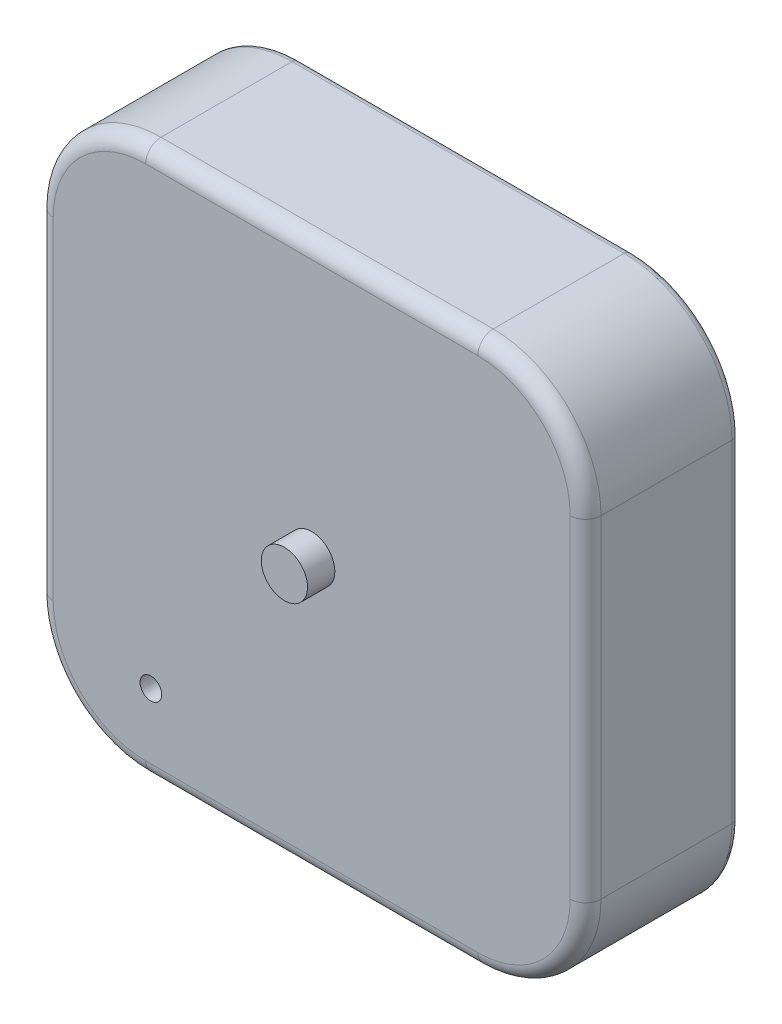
ISO-10303-21;
HEADER;
FILE_DESCRIPTION(('STEP AP214'),'2;1');
FILE_NAME('part.step','',(''),(''),'','','');
FILE_SCHEMA(('AUTOMOTIVE_DESIGN { 1 0 10303 214 1 1 1 1 }'));
ENDSEC;
DATA;
#1=APPLICATION_CONTEXT('core data for automotive mechanical design processes');
#2=APPLICATION_PROTOCOL_DEFINITION('international standard','automotive_design',2000,#1);
#3=PRODUCT_CONTEXT('',#1,'mechanical');
#4=PRODUCT('Part','Part','',(#3));
#5=PRODUCT_RELATED_PRODUCT_CATEGORY('part','',(#4));
#6=PRODUCT_DEFINITION_FORMATION('','',#4);
#7=PRODUCT_DEFINITION_CONTEXT('part definition',#1,'design');
#8=PRODUCT_DEFINITION('design','',#6,#7);
#9=PRODUCT_DEFINITION_SHAPE('','',#8);
#10=(LENGTH_UNIT() NAMED_UNIT(*) SI_UNIT(.MILLI.,.METRE.));
#11=(NAMED_UNIT(*) PLANE_ANGLE_UNIT() SI_UNIT($,.RADIAN.));
#12=(NAMED_UNIT(*) SI_UNIT($,.STERADIAN.) SOLID_ANGLE_UNIT());
#13=UNCERTAINTY_MEASURE_WITH_UNIT(LENGTH_MEASURE(1.E-05),#10,'distance_accuracy_value','');
#14=(GEOMETRIC_REPRESENTATION_CONTEXT(3) GLOBAL_UNCERTAINTY_ASSIGNED_CONTEXT((#13)) GLOBAL_UNIT_ASSIGNED_CONTEXT((#10,
#11,#12)) REPRESENTATION_CONTEXT('',''));
#15=CARTESIAN_POINT('',(0.,0.,0.));
#16=DIRECTION('',(0.,0.,1.));
#17=DIRECTION('',(1.,0.,0.));
#18=AXIS2_PLACEMENT_3D('',#15,#16,#17);
#19=CARTESIAN_POINT('',(0.,0.,0.));
#20=DIRECTION('',(0.,0.,1.));
#21=DIRECTION('',(1.,0.,0.));
#22=AXIS2_PLACEMENT_3D('',#19,#20,#21);
#23=PLANE('',#22);
#24=DIRECTION('',(1.,0.,0.));
#25=VECTOR('',#24,1.);
#26=CARTESIAN_POINT('',(0.,-172.8,0.));
#27=LINE('',#26,#25);
#28=CARTESIAN_POINT('',(107.8,-172.8,0.));
#29=VERTEX_POINT('',#28);
#30=CARTESIAN_POINT('',(-107.8,-172.8,0.));
#31=VERTEX_POINT('',#30);
#32=EDGE_CURVE('E185',#29,#31,#27,.F.);
#33=ORIENTED_EDGE('',*,*,#32,.T.);
#34=CARTESIAN_POINT('',(-107.8,-107.8,0.));
#35=DIRECTION('',(0.,0.,1.));
#36=DIRECTION('',(1.,0.,0.));
#37=AXIS2_PLACEMENT_3D('',#34,#35,#36);
#38=CIRCLE('',#37,65.);
#39=CARTESIAN_POINT('',(-172.8,-107.8,0.));
#40=VERTEX_POINT('',#39);
#41=EDGE_CURVE('E224',#31,#40,#38,.F.);
#42=ORIENTED_EDGE('',*,*,#41,.T.);
#43=DIRECTION('',(0.,-1.,0.));
#44=VECTOR('',#43,1.);
#45=CARTESIAN_POINT('',(-172.8,0.,0.));
#46=LINE('',#45,#44);
#47=CARTESIAN_POINT('',(-172.8,107.8,0.));
#48=VERTEX_POINT('',#47);
#49=EDGE_CURVE('E222',#40,#48,#46,.F.);
#50=ORIENTED_EDGE('',*,*,#49,.T.);
#51=CARTESIAN_POINT('',(-107.8,107.8,0.));
#52=DIRECTION('',(0.,0.,1.));
#53=DIRECTION('',(1.,0.,0.));
#54=AXIS2_PLACEMENT_3D('',#51,#52,#53);
#55=CIRCLE('',#54,65.);
#56=CARTESIAN_POINT('',(-107.8,172.8,0.));
#57=VERTEX_POINT('',#56);
#58=EDGE_CURVE('E220',#48,#57,#55,.F.);
#59=ORIENTED_EDGE('',*,*,#58,.T.);
#60=DIRECTION('',(1.,0.,0.));
#61=VECTOR('',#60,1.);
#62=CARTESIAN_POINT('',(107.8,172.8,0.));
#63=LINE('',#62,#61);
#64=CARTESIAN_POINT('',(107.8,172.8,0.));
#65=VERTEX_POINT('',#64);
#66=EDGE_CURVE('E218',#57,#65,#63,.T.);
#67=ORIENTED_EDGE('',*,*,#66,.T.);
#68=CARTESIAN_POINT('',(107.8,107.8,0.));
#69=DIRECTION('',(0.,0.,1.));
#70=DIRECTION('',(1.,0.,0.));
#71=AXIS2_PLACEMENT_3D('',#68,#69,#70);
#72=CIRCLE('',#71,65.);
#73=CARTESIAN_POINT('',(172.8,107.8,0.));
#74=VERTEX_POINT('',#73);
#75=EDGE_CURVE('E216',#65,#74,#72,.F.);
#76=ORIENTED_EDGE('',*,*,#75,.T.);
#77=DIRECTION('',(0.,-1.,0.));
#78=VECTOR('',#77,1.);
#79=CARTESIAN_POINT('',(172.8,-107.8,0.));
#80=LINE('',#79,#78);
#81=CARTESIAN_POINT('',(172.8,-107.8,0.));
#82=VERTEX_POINT('',#81);
#83=EDGE_CURVE('E188',#74,#82,#80,.T.);
#84=ORIENTED_EDGE('',*,*,#83,.T.);
#85=CARTESIAN_POINT('',(107.8,-107.8,0.));
#86=DIRECTION('',(0.,0.,1.));
#87=DIRECTION('',(1.,0.,0.));
#88=AXIS2_PLACEMENT_3D('',#85,#86,#87);
#89=CIRCLE('',#88,65.);
#90=EDGE_CURVE('E181',#82,#29,#89,.F.);
#91=ORIENTED_EDGE('',*,*,#90,.T.);
#92=EDGE_LOOP('',(#33,#42,#50,#59,#67,#76,#84,#91));
#93=FACE_BOUND('',#92,.T.);
#94=ADVANCED_FACE('F67',(#93),#23,.F.);
#95=CARTESIAN_POINT('',(-177.8,0.,100.));
#96=DIRECTION('',(1.,0.,0.));
#97=DIRECTION('',(0.,1.,0.));
#98=AXIS2_PLACEMENT_3D('',#95,#96,#97);
#99=PLANE('',#98);
#100=DIRECTION('',(0.,0.,-1.));
#101=VECTOR('',#100,1.);
#102=CARTESIAN_POINT('',(-177.8,-107.8,100.));
#103=LINE('',#102,#101);
#104=CARTESIAN_POINT('',(-177.8,-107.8,5.));
#105=VERTEX_POINT('',#104);
#106=CARTESIAN_POINT('',(-177.8,-107.8,90.));
#107=VERTEX_POINT('',#106);
#108=EDGE_CURVE('E208',#105,#107,#103,.F.);
#109=ORIENTED_EDGE('',*,*,#108,.T.);
#110=DIRECTION('',(0.,-1.,0.));
#111=VECTOR('',#110,1.);
#112=CARTESIAN_POINT('',(-177.8,107.8,90.));
#113=LINE('',#112,#111);
#114=CARTESIAN_POINT('',(-177.8,107.8,90.));
#115=VERTEX_POINT('',#114);
#116=EDGE_CURVE('E280',#107,#115,#113,.F.);
#117=ORIENTED_EDGE('',*,*,#116,.T.);
#118=DIRECTION('',(0.,0.,-1.));
#119=VECTOR('',#118,1.);
#120=CARTESIAN_POINT('',(-177.8,107.8,0.));
#121=LINE('',#120,#119);
#122=CARTESIAN_POINT('',(-177.8,107.8,5.));
#123=VERTEX_POINT('',#122);
#124=EDGE_CURVE('E211',#115,#123,#121,.T.);
#125=ORIENTED_EDGE('',*,*,#124,.T.);
#126=DIRECTION('',(0.,-1.,0.));
#127=VECTOR('',#126,1.);
#128=CARTESIAN_POINT('',(-177.8,0.,5.));
#129=LINE('',#128,#127);
#130=EDGE_CURVE('E229',#123,#105,#129,.T.);
#131=ORIENTED_EDGE('',*,*,#130,.T.);
#132=EDGE_LOOP('',(#109,#117,#125,#131));
#133=FACE_BOUND('',#132,.T.);
#134=ADVANCED_FACE('F340',(#133),#99,.F.);
#135=CARTESIAN_POINT('',(0.,177.8,100.));
#136=DIRECTION('',(0.,1.,0.));
#137=DIRECTION('',(0.,0.,1.));
#138=AXIS2_PLACEMENT_3D('',#135,#136,#137);
#139=PLANE('',#138);
#140=DIRECTION('',(0.,0.,-1.));
#141=VECTOR('',#140,1.);
#142=CARTESIAN_POINT('',(-107.8,177.8,100.));
#143=LINE('',#142,#141);
#144=CARTESIAN_POINT('',(-107.8,177.8,5.));
#145=VERTEX_POINT('',#144);
#146=CARTESIAN_POINT('',(-107.8,177.8,90.));
#147=VERTEX_POINT('',#146);
#148=EDGE_CURVE('E351',#145,#147,#143,.F.);
#149=ORIENTED_EDGE('',*,*,#148,.T.);
#150=DIRECTION('',(1.,0.,0.));
#151=VECTOR('',#150,1.);
#152=CARTESIAN_POINT('',(0.,177.8,90.));
#153=LINE('',#152,#151);
#154=CARTESIAN_POINT('',(107.8,177.8,90.));
#155=VERTEX_POINT('',#154);
#156=EDGE_CURVE('E284',#147,#155,#153,.T.);
#157=ORIENTED_EDGE('',*,*,#156,.T.);
#158=DIRECTION('',(0.,0.,-1.));
#159=VECTOR('',#158,1.);
#160=CARTESIAN_POINT('',(107.8,177.8,100.));
#161=LINE('',#160,#159);
#162=CARTESIAN_POINT('',(107.8,177.8,5.));
#163=VERTEX_POINT('',#162);
#164=EDGE_CURVE('E327',#155,#163,#161,.T.);
#165=ORIENTED_EDGE('',*,*,#164,.T.);
#166=DIRECTION('',(1.,0.,0.));
#167=VECTOR('',#166,1.);
#168=CARTESIAN_POINT('',(-107.8,177.8,5.));
#169=LINE('',#168,#167);
#170=EDGE_CURVE('E234',#163,#145,#169,.F.);
#171=ORIENTED_EDGE('',*,*,#170,.T.);
#172=EDGE_LOOP('',(#149,#157,#165,#171));
#173=FACE_BOUND('',#172,.T.);
#174=ADVANCED_FACE('F389',(#173),#139,.T.);
#175=CARTESIAN_POINT('',(177.8,0.,100.));
#176=DIRECTION('',(1.,0.,0.));
#177=DIRECTION('',(0.,1.,0.));
#178=AXIS2_PLACEMENT_3D('',#175,#176,#177);
#179=PLANE('',#178);
#180=DIRECTION('',(0.,0.,-1.));
#181=VECTOR('',#180,1.);
#182=CARTESIAN_POINT('',(177.8,107.8,100.));
#183=LINE('',#182,#181);
#184=CARTESIAN_POINT('',(177.8,107.8,5.));
#185=VERTEX_POINT('',#184);
#186=CARTESIAN_POINT('',(177.8,107.8,90.));
#187=VERTEX_POINT('',#186);
#188=EDGE_CURVE('E325',#185,#187,#183,.F.);
#189=ORIENTED_EDGE('',*,*,#188,.T.);
#190=DIRECTION('',(0.,-1.,0.));
#191=VECTOR('',#190,1.);
#192=CARTESIAN_POINT('',(177.8,0.,90.));
#193=LINE('',#192,#191);
#194=CARTESIAN_POINT('',(177.8,-107.8,90.));
#195=VERTEX_POINT('',#194);
#196=EDGE_CURVE('E91',#187,#195,#193,.T.);
#197=ORIENTED_EDGE('',*,*,#196,.T.);
#198=DIRECTION('',(0.,0.,-1.));
#199=VECTOR('',#198,1.);
#200=CARTESIAN_POINT('',(177.8,-107.8,0.));
#201=LINE('',#200,#199);
#202=CARTESIAN_POINT('',(177.8,-107.8,5.));
#203=VERTEX_POINT('',#202);
#204=EDGE_CURVE('E331',#195,#203,#201,.T.);
#205=ORIENTED_EDGE('',*,*,#204,.T.);
#206=DIRECTION('',(0.,-1.,0.));
#207=VECTOR('',#206,1.);
#208=CARTESIAN_POINT('',(177.8,107.8,5.));
#209=LINE('',#208,#207);
#210=EDGE_CURVE('E239',#203,#185,#209,.F.);
#211=ORIENTED_EDGE('',*,*,#210,.T.);
#212=EDGE_LOOP('',(#189,#197,#205,#211));
#213=FACE_BOUND('',#212,.T.);
#214=ADVANCED_FACE('F328',(#213),#179,.T.);
#215=CARTESIAN_POINT('',(0.,-177.8,100.));
#216=DIRECTION('',(0.,1.,0.));
#217=DIRECTION('',(0.,0.,1.));
#218=AXIS2_PLACEMENT_3D('',#215,#216,#217);
#219=PLANE('',#218);
#220=DIRECTION('',(0.,0.,-1.));
#221=VECTOR('',#220,1.);
#222=CARTESIAN_POINT('',(107.8,-177.8,100.));
#223=LINE('',#222,#221);
#224=CARTESIAN_POINT('',(107.8,-177.8,5.));
#225=VERTEX_POINT('',#224);
#226=CARTESIAN_POINT('',(107.8,-177.8,90.));
#227=VERTEX_POINT('',#226);
#228=EDGE_CURVE('E333',#225,#227,#223,.F.);
#229=ORIENTED_EDGE('',*,*,#228,.T.);
#230=DIRECTION('',(1.,0.,0.));
#231=VECTOR('',#230,1.);
#232=CARTESIAN_POINT('',(-107.8,-177.8,90.));
#233=LINE('',#232,#231);
#234=CARTESIAN_POINT('',(-107.8,-177.8,90.));
#235=VERTEX_POINT('',#234);
#236=EDGE_CURVE('E12',#227,#235,#233,.F.);
#237=ORIENTED_EDGE('',*,*,#236,.T.);
#238=DIRECTION('',(0.,0.,-1.));
#239=VECTOR('',#238,1.);
#240=CARTESIAN_POINT('',(-107.8,-177.8,100.));
#241=LINE('',#240,#239);
#242=CARTESIAN_POINT('',(-107.8,-177.8,5.));
#243=VERTEX_POINT('',#242);
#244=EDGE_CURVE('E330',#235,#243,#241,.T.);
#245=ORIENTED_EDGE('',*,*,#244,.T.);
#246=DIRECTION('',(1.,0.,0.));
#247=VECTOR('',#246,1.);
#248=CARTESIAN_POINT('',(0.,-177.8,5.));
#249=LINE('',#248,#247);
#250=EDGE_CURVE('E242',#243,#225,#249,.T.);
#251=ORIENTED_EDGE('',*,*,#250,.T.);
#252=EDGE_LOOP('',(#229,#237,#245,#251));
#253=FACE_BOUND('',#252,.T.);
#254=ADVANCED_FACE('F413',(#253),#219,.F.);
#255=CARTESIAN_POINT('',(0.,0.,100.));
#256=DIRECTION('',(0.,0.,1.));
#257=DIRECTION('',(1.,0.,0.));
#258=AXIS2_PLACEMENT_3D('',#255,#256,#257);
#259=PLANE('',#258);
#260=CARTESIAN_POINT('',(0.,0.,100.));
#261=DIRECTION('',(0.,0.,1.));
#262=DIRECTION('',(1.,0.,0.));
#263=AXIS2_PLACEMENT_3D('',#260,#261,#262);
#264=CIRCLE('',#263,15.);
#265=CARTESIAN_POINT('',(15.,0.,100.));
#266=VERTEX_POINT('',#265);
#267=EDGE_CURVE('E398',#266,#266,#264,.T.);
#268=ORIENTED_EDGE('',*,*,#267,.F.);
#269=EDGE_LOOP('',(#268));
#270=FACE_BOUND('',#269,.T.);
#271=DIRECTION('',(0.,-1.,0.));
#272=VECTOR('',#271,1.);
#273=CARTESIAN_POINT('',(-167.8,-107.8,100.));
#274=LINE('',#273,#272);
#275=CARTESIAN_POINT('',(-167.8,107.8,100.));
#276=VERTEX_POINT('',#275);
#277=CARTESIAN_POINT('',(-167.8,-107.8,100.));
#278=VERTEX_POINT('',#277);
#279=EDGE_CURVE('E272',#276,#278,#274,.T.);
#280=ORIENTED_EDGE('',*,*,#279,.T.);
#281=CARTESIAN_POINT('',(-107.8,-107.8,100.));
#282=DIRECTION('',(0.,0.,1.));
#283=DIRECTION('',(1.,0.,0.));
#284=AXIS2_PLACEMENT_3D('',#281,#282,#283);
#285=CIRCLE('',#284,60.);
#286=CARTESIAN_POINT('',(-107.8,-167.8,100.));
#287=VERTEX_POINT('',#286);
#288=EDGE_CURVE('E274',#278,#287,#285,.T.);
#289=ORIENTED_EDGE('',*,*,#288,.T.);
#290=DIRECTION('',(1.,0.,0.));
#291=VECTOR('',#290,1.);
#292=CARTESIAN_POINT('',(107.8,-167.8,100.));
#293=LINE('',#292,#291);
#294=CARTESIAN_POINT('',(107.8,-167.8,100.));
#295=VERTEX_POINT('',#294);
#296=EDGE_CURVE('E244',#287,#295,#293,.T.);
#297=ORIENTED_EDGE('',*,*,#296,.T.);
#298=CARTESIAN_POINT('',(107.8,-107.8,100.));
#299=DIRECTION('',(0.,0.,1.));
#300=DIRECTION('',(1.,0.,0.));
#301=AXIS2_PLACEMENT_3D('',#298,#299,#300);
#302=CIRCLE('',#301,60.);
#303=CARTESIAN_POINT('',(167.8,-107.8,100.));
#304=VERTEX_POINT('',#303);
#305=EDGE_CURVE('E262',#295,#304,#302,.T.);
#306=ORIENTED_EDGE('',*,*,#305,.T.);
#307=DIRECTION('',(0.,-1.,0.));
#308=VECTOR('',#307,1.);
#309=CARTESIAN_POINT('',(167.8,0.,100.));
#310=LINE('',#309,#308);
#311=CARTESIAN_POINT('',(167.8,107.8,100.));
#312=VERTEX_POINT('',#311);
#313=EDGE_CURVE('E264',#304,#312,#310,.F.);
#314=ORIENTED_EDGE('',*,*,#313,.T.);
#315=CARTESIAN_POINT('',(107.8,107.8,100.));
#316=DIRECTION('',(0.,0.,1.));
#317=DIRECTION('',(1.,0.,0.));
#318=AXIS2_PLACEMENT_3D('',#315,#316,#317);
#319=CIRCLE('',#318,60.);
#320=CARTESIAN_POINT('',(107.8,167.8,100.));
#321=VERTEX_POINT('',#320);
#322=EDGE_CURVE('E266',#312,#321,#319,.T.);
#323=ORIENTED_EDGE('',*,*,#322,.T.);
#324=DIRECTION('',(1.,0.,0.));
#325=VECTOR('',#324,1.);
#326=CARTESIAN_POINT('',(0.,167.8,100.));
#327=LINE('',#326,#325);
#328=CARTESIAN_POINT('',(-107.8,167.8,100.));
#329=VERTEX_POINT('',#328);
#330=EDGE_CURVE('E268',#321,#329,#327,.F.);
#331=ORIENTED_EDGE('',*,*,#330,.T.);
#332=CARTESIAN_POINT('',(-107.8,107.8,100.));
#333=DIRECTION('',(0.,0.,1.));
#334=DIRECTION('',(1.,0.,0.));
#335=AXIS2_PLACEMENT_3D('',#332,#333,#334);
#336=CIRCLE('',#335,60.);
#337=EDGE_CURVE('E270',#329,#276,#336,.T.);
#338=ORIENTED_EDGE('',*,*,#337,.T.);
#339=EDGE_LOOP('',(#280,#289,#297,#306,#314,#323,#331,#338));
#340=FACE_BOUND('',#339,.T.);
#341=CARTESIAN_POINT('',(-104.42,-125.46,100.));
#342=DIRECTION('',(0.,0.,1.));
#343=DIRECTION('',(1.,0.,0.));
#344=AXIS2_PLACEMENT_3D('',#341,#342,#343);
#345=CIRCLE('',#344,7.02999999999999);
#346=CARTESIAN_POINT('',(-97.39,-125.46,100.));
#347=VERTEX_POINT('',#346);
#348=EDGE_CURVE('E260',#347,#347,#345,.T.);
#349=ORIENTED_EDGE('',*,*,#348,.F.);
#350=EDGE_LOOP('',(#349));
#351=FACE_BOUND('',#350,.T.);
#352=ADVANCED_FACE('F379',(#270,#340,#351),#259,.T.);
#353=CARTESIAN_POINT('',(107.8,107.8,100.));
#354=DIRECTION('',(0.,0.,-1.));
#355=DIRECTION('',(-1.,0.,0.));
#356=AXIS2_PLACEMENT_3D('',#353,#354,#355);
#357=CYLINDRICAL_SURFACE('',#356,70.);
#358=ORIENTED_EDGE('',*,*,#164,.F.);
#359=CARTESIAN_POINT('',(107.8,107.8,90.));
#360=DIRECTION('',(0.,0.,1.));
#361=DIRECTION('',(1.,0.,0.));
#362=AXIS2_PLACEMENT_3D('',#359,#360,#361);
#363=CIRCLE('',#362,70.);
#364=EDGE_CURVE('E286',#155,#187,#363,.F.);
#365=ORIENTED_EDGE('',*,*,#364,.T.);
#366=ORIENTED_EDGE('',*,*,#188,.F.);
#367=CARTESIAN_POINT('',(107.8,107.8,5.));
#368=DIRECTION('',(0.,0.,1.));
#369=DIRECTION('',(1.,0.,0.));
#370=AXIS2_PLACEMENT_3D('',#367,#368,#369);
#371=CIRCLE('',#370,70.);
#372=EDGE_CURVE('E236',#185,#163,#371,.T.);
#373=ORIENTED_EDGE('',*,*,#372,.T.);
#374=EDGE_LOOP('',(#358,#365,#366,#373));
#375=FACE_BOUND('',#374,.T.);
#376=ADVANCED_FACE('F324',(#375),#357,.T.);
#377=CARTESIAN_POINT('',(107.8,-107.8,100.));
#378=DIRECTION('',(0.,0.,1.));
#379=DIRECTION('',(1.,0.,0.));
#380=AXIS2_PLACEMENT_3D('',#377,#378,#379);
#381=CYLINDRICAL_SURFACE('',#380,70.);
#382=ORIENTED_EDGE('',*,*,#204,.F.);
#383=CARTESIAN_POINT('',(107.8,-107.8,90.));
#384=DIRECTION('',(0.,0.,1.));
#385=DIRECTION('',(1.,0.,0.));
#386=AXIS2_PLACEMENT_3D('',#383,#384,#385);
#387=CIRCLE('',#386,70.);
#388=EDGE_CURVE('E76',#195,#227,#387,.F.);
#389=ORIENTED_EDGE('',*,*,#388,.T.);
#390=ORIENTED_EDGE('',*,*,#228,.F.);
#391=CARTESIAN_POINT('',(107.8,-107.8,5.));
#392=DIRECTION('',(0.,0.,1.));
#393=DIRECTION('',(1.,0.,0.));
#394=AXIS2_PLACEMENT_3D('',#391,#392,#393);
#395=CIRCLE('',#394,70.);
#396=EDGE_CURVE('E198',#225,#203,#395,.T.);
#397=ORIENTED_EDGE('',*,*,#396,.T.);
#398=EDGE_LOOP('',(#382,#389,#390,#397));
#399=FACE_BOUND('',#398,.T.);
#400=ADVANCED_FACE('F419',(#399),#381,.T.);
#401=CARTESIAN_POINT('',(-107.8,-107.8,100.));
#402=DIRECTION('',(0.,0.,-1.));
#403=DIRECTION('',(-1.,0.,0.));
#404=AXIS2_PLACEMENT_3D('',#401,#402,#403);
#405=CYLINDRICAL_SURFACE('',#404,70.);
#406=ORIENTED_EDGE('',*,*,#244,.F.);
#407=CARTESIAN_POINT('',(-107.8,-107.8,90.));
#408=DIRECTION('',(0.,0.,1.));
#409=DIRECTION('',(1.,0.,0.));
#410=AXIS2_PLACEMENT_3D('',#407,#408,#409);
#411=CIRCLE('',#410,70.);
#412=EDGE_CURVE('E277',#235,#107,#411,.F.);
#413=ORIENTED_EDGE('',*,*,#412,.T.);
#414=ORIENTED_EDGE('',*,*,#108,.F.);
#415=CARTESIAN_POINT('',(-107.8,-107.8,5.));
#416=DIRECTION('',(0.,0.,1.));
#417=DIRECTION('',(1.,0.,0.));
#418=AXIS2_PLACEMENT_3D('',#415,#416,#417);
#419=CIRCLE('',#418,70.);
#420=EDGE_CURVE('E226',#105,#243,#419,.T.);
#421=ORIENTED_EDGE('',*,*,#420,.T.);
#422=EDGE_LOOP('',(#406,#413,#414,#421));
#423=FACE_BOUND('',#422,.T.);
#424=ADVANCED_FACE('F365',(#423),#405,.T.);
#425=CARTESIAN_POINT('',(-107.8,107.8,100.));
#426=DIRECTION('',(0.,0.,1.));
#427=DIRECTION('',(1.,0.,0.));
#428=AXIS2_PLACEMENT_3D('',#425,#426,#427);
#429=CYLINDRICAL_SURFACE('',#428,70.);
#430=ORIENTED_EDGE('',*,*,#124,.F.);
#431=CARTESIAN_POINT('',(-107.8,107.8,90.));
#432=DIRECTION('',(0.,0.,1.));
#433=DIRECTION('',(1.,0.,0.));
#434=AXIS2_PLACEMENT_3D('',#431,#432,#433);
#435=CIRCLE('',#434,70.);
#436=EDGE_CURVE('E282',#115,#147,#435,.F.);
#437=ORIENTED_EDGE('',*,*,#436,.T.);
#438=ORIENTED_EDGE('',*,*,#148,.F.);
#439=CARTESIAN_POINT('',(-107.8,107.8,5.));
#440=DIRECTION('',(0.,0.,1.));
#441=DIRECTION('',(1.,0.,0.));
#442=AXIS2_PLACEMENT_3D('',#439,#440,#441);
#443=CIRCLE('',#442,70.);
#444=EDGE_CURVE('E231',#145,#123,#443,.T.);
#445=ORIENTED_EDGE('',*,*,#444,.T.);
#446=EDGE_LOOP('',(#430,#437,#438,#445));
#447=FACE_BOUND('',#446,.T.);
#448=ADVANCED_FACE('F349',(#447),#429,.T.);
#449=CARTESIAN_POINT('',(-104.42,-125.46,74.96));
#450=DIRECTION('',(0.,0.,1.));
#451=DIRECTION('',(1.,0.,0.));
#452=AXIS2_PLACEMENT_3D('',#449,#450,#451);
#453=CYLINDRICAL_SURFACE('',#452,7.02999999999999);
#454=CARTESIAN_POINT('',(-104.42,-125.46,74.96));
#455=DIRECTION('',(0.,0.,1.));
#456=DIRECTION('',(1.,0.,0.));
#457=AXIS2_PLACEMENT_3D('',#454,#455,#456);
#458=CIRCLE('',#457,7.02999999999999);
#459=CARTESIAN_POINT('',(-97.39,-125.46,74.96));
#460=VERTEX_POINT('',#459);
#461=EDGE_CURVE('E391',#460,#460,#458,.T.);
#462=ORIENTED_EDGE('',*,*,#461,.F.);
#463=EDGE_LOOP('',(#462));
#464=FACE_BOUND('',#463,.T.);
#465=ORIENTED_EDGE('',*,*,#348,.T.);
#466=EDGE_LOOP('',(#465));
#467=FACE_BOUND('',#466,.T.);
#468=ADVANCED_FACE('F443',(#464,#467),#453,.F.);
#469=CARTESIAN_POINT('',(-104.42,-125.46,74.96));
#470=DIRECTION('',(0.,0.,1.));
#471=DIRECTION('',(1.,0.,0.));
#472=AXIS2_PLACEMENT_3D('',#469,#470,#471);
#473=PLANE('',#472);
#474=ORIENTED_EDGE('',*,*,#461,.T.);
#475=EDGE_LOOP('',(#474));
#476=FACE_BOUND('',#475,.T.);
#477=ADVANCED_FACE('F464',(#476),#473,.T.);
#478=CARTESIAN_POINT('',(107.8,107.8,5.));
#479=DIRECTION('',(0.,0.,1.));
#480=DIRECTION('',(1.,0.,0.));
#481=AXIS2_PLACEMENT_3D('',#478,#479,#480);
#482=TOROIDAL_SURFACE('',#481,65.,5.);
#483=CARTESIAN_POINT('',(107.8,172.8,5.));
#484=DIRECTION('',(-1.,0.,0.));
#485=DIRECTION('',(0.,0.,1.));
#486=AXIS2_PLACEMENT_3D('',#483,#484,#485);
#487=CIRCLE('',#486,5.);
#488=EDGE_CURVE('E254',#163,#65,#487,.T.);
#489=ORIENTED_EDGE('',*,*,#488,.F.);
#490=ORIENTED_EDGE('',*,*,#372,.F.);
#491=CARTESIAN_POINT('',(172.8,107.8,5.));
#492=DIRECTION('',(0.,-1.,0.));
#493=DIRECTION('',(0.,0.,-1.));
#494=AXIS2_PLACEMENT_3D('',#491,#492,#493);
#495=CIRCLE('',#494,5.);
#496=EDGE_CURVE('E257',#74,#185,#495,.T.);
#497=ORIENTED_EDGE('',*,*,#496,.F.);
#498=ORIENTED_EDGE('',*,*,#75,.F.);
#499=EDGE_LOOP('',(#489,#490,#497,#498));
#500=FACE_BOUND('',#499,.T.);
#501=ADVANCED_FACE('F460',(#500),#482,.T.);
#502=CARTESIAN_POINT('',(172.8,0.,5.));
#503=DIRECTION('',(0.,1.,0.));
#504=DIRECTION('',(-1.,0.,0.));
#505=AXIS2_PLACEMENT_3D('',#502,#503,#504);
#506=CYLINDRICAL_SURFACE('',#505,5.);
#507=ORIENTED_EDGE('',*,*,#496,.T.);
#508=ORIENTED_EDGE('',*,*,#210,.F.);
#509=CARTESIAN_POINT('',(172.8,-107.8,5.));
#510=DIRECTION('',(0.,-1.,0.));
#511=DIRECTION('',(0.,0.,-1.));
#512=AXIS2_PLACEMENT_3D('',#509,#510,#511);
#513=CIRCLE('',#512,5.);
#514=EDGE_CURVE('E252',#82,#203,#513,.T.);
#515=ORIENTED_EDGE('',*,*,#514,.F.);
#516=ORIENTED_EDGE('',*,*,#83,.F.);
#517=EDGE_LOOP('',(#507,#508,#515,#516));
#518=FACE_BOUND('',#517,.T.);
#519=ADVANCED_FACE('F456',(#518),#506,.T.);
#520=CARTESIAN_POINT('',(0.,172.8,5.));
#521=DIRECTION('',(-1.,0.,0.));
#522=DIRECTION('',(0.,0.,1.));
#523=AXIS2_PLACEMENT_3D('',#520,#521,#522);
#524=CYLINDRICAL_SURFACE('',#523,5.);
#525=ORIENTED_EDGE('',*,*,#488,.T.);
#526=ORIENTED_EDGE('',*,*,#66,.F.);
#527=CARTESIAN_POINT('',(-107.8,172.8,5.));
#528=DIRECTION('',(-1.,0.,0.));
#529=DIRECTION('',(0.,0.,1.));
#530=AXIS2_PLACEMENT_3D('',#527,#528,#529);
#531=CIRCLE('',#530,5.);
#532=EDGE_CURVE('E201',#145,#57,#531,.T.);
#533=ORIENTED_EDGE('',*,*,#532,.F.);
#534=ORIENTED_EDGE('',*,*,#170,.F.);
#535=EDGE_LOOP('',(#525,#526,#533,#534));
#536=FACE_BOUND('',#535,.T.);
#537=ADVANCED_FACE('F453',(#536),#524,.T.);
#538=CARTESIAN_POINT('',(107.8,-107.8,5.));
#539=DIRECTION('',(0.,0.,1.));
#540=DIRECTION('',(1.,0.,0.));
#541=AXIS2_PLACEMENT_3D('',#538,#539,#540);
#542=TOROIDAL_SURFACE('',#541,65.,5.);
#543=ORIENTED_EDGE('',*,*,#514,.T.);
#544=ORIENTED_EDGE('',*,*,#396,.F.);
#545=CARTESIAN_POINT('',(107.8,-172.8,5.));
#546=DIRECTION('',(-1.,0.,0.));
#547=DIRECTION('',(0.,0.,1.));
#548=AXIS2_PLACEMENT_3D('',#545,#546,#547);
#549=CIRCLE('',#548,5.);
#550=EDGE_CURVE('E195',#29,#225,#549,.T.);
#551=ORIENTED_EDGE('',*,*,#550,.F.);
#552=ORIENTED_EDGE('',*,*,#90,.F.);
#553=EDGE_LOOP('',(#543,#544,#551,#552));
#554=FACE_BOUND('',#553,.T.);
#555=ADVANCED_FACE('F196',(#554),#542,.T.);
#556=CARTESIAN_POINT('',(-107.8,107.8,5.));
#557=DIRECTION('',(0.,0.,1.));
#558=DIRECTION('',(1.,0.,0.));
#559=AXIS2_PLACEMENT_3D('',#556,#557,#558);
#560=TOROIDAL_SURFACE('',#559,65.,5.);
#561=ORIENTED_EDGE('',*,*,#532,.T.);
#562=ORIENTED_EDGE('',*,*,#58,.F.);
#563=CARTESIAN_POINT('',(-172.8,107.8,5.));
#564=DIRECTION('',(0.,-1.,0.));
#565=DIRECTION('',(0.,0.,-1.));
#566=AXIS2_PLACEMENT_3D('',#563,#564,#565);
#567=CIRCLE('',#566,5.);
#568=EDGE_CURVE('E202',#123,#48,#567,.T.);
#569=ORIENTED_EDGE('',*,*,#568,.F.);
#570=ORIENTED_EDGE('',*,*,#444,.F.);
#571=EDGE_LOOP('',(#561,#562,#569,#570));
#572=FACE_BOUND('',#571,.T.);
#573=ADVANCED_FACE('F355',(#572),#560,.T.);
#574=CARTESIAN_POINT('',(0.,-172.8,5.));
#575=DIRECTION('',(1.,0.,0.));
#576=DIRECTION('',(0.,0.,-1.));
#577=AXIS2_PLACEMENT_3D('',#574,#575,#576);
#578=CYLINDRICAL_SURFACE('',#577,5.);
#579=ORIENTED_EDGE('',*,*,#550,.T.);
#580=ORIENTED_EDGE('',*,*,#250,.F.);
#581=CARTESIAN_POINT('',(-107.8,-172.8,5.));
#582=DIRECTION('',(-1.,0.,0.));
#583=DIRECTION('',(0.,0.,1.));
#584=AXIS2_PLACEMENT_3D('',#581,#582,#583);
#585=CIRCLE('',#584,5.);
#586=EDGE_CURVE('E206',#31,#243,#585,.T.);
#587=ORIENTED_EDGE('',*,*,#586,.F.);
#588=ORIENTED_EDGE('',*,*,#32,.F.);
#589=EDGE_LOOP('',(#579,#580,#587,#588));
#590=FACE_BOUND('',#589,.T.);
#591=ADVANCED_FACE('F204',(#590),#578,.T.);
#592=CARTESIAN_POINT('',(-172.8,0.,5.));
#593=DIRECTION('',(0.,-1.,0.));
#594=DIRECTION('',(1.,0.,0.));
#595=AXIS2_PLACEMENT_3D('',#592,#593,#594);
#596=CYLINDRICAL_SURFACE('',#595,5.);
#597=ORIENTED_EDGE('',*,*,#568,.T.);
#598=ORIENTED_EDGE('',*,*,#49,.F.);
#599=CARTESIAN_POINT('',(-172.8,-107.8,5.));
#600=DIRECTION('',(0.,-1.,0.));
#601=DIRECTION('',(0.,0.,-1.));
#602=AXIS2_PLACEMENT_3D('',#599,#600,#601);
#603=CIRCLE('',#602,5.);
#604=EDGE_CURVE('E245',#105,#40,#603,.T.);
#605=ORIENTED_EDGE('',*,*,#604,.F.);
#606=ORIENTED_EDGE('',*,*,#130,.F.);
#607=EDGE_LOOP('',(#597,#598,#605,#606));
#608=FACE_BOUND('',#607,.T.);
#609=ADVANCED_FACE('F359',(#608),#596,.T.);
#610=CARTESIAN_POINT('',(-107.8,-107.8,5.));
#611=DIRECTION('',(0.,0.,1.));
#612=DIRECTION('',(1.,0.,0.));
#613=AXIS2_PLACEMENT_3D('',#610,#611,#612);
#614=TOROIDAL_SURFACE('',#613,65.,5.);
#615=ORIENTED_EDGE('',*,*,#586,.T.);
#616=ORIENTED_EDGE('',*,*,#420,.F.);
#617=ORIENTED_EDGE('',*,*,#604,.T.);
#618=ORIENTED_EDGE('',*,*,#41,.F.);
#619=EDGE_LOOP('',(#615,#616,#617,#618));
#620=FACE_BOUND('',#619,.T.);
#621=ADVANCED_FACE('F362',(#620),#614,.T.);
#622=CARTESIAN_POINT('',(107.8,107.8,90.));
#623=DIRECTION('',(0.,0.,1.));
#624=DIRECTION('',(1.,0.,0.));
#625=AXIS2_PLACEMENT_3D('',#622,#623,#624);
#626=TOROIDAL_SURFACE('',#625,60.,10.);
#627=CARTESIAN_POINT('',(167.8,107.8,90.));
#628=DIRECTION('',(0.,-1.,0.));
#629=DIRECTION('',(0.,0.,-1.));
#630=AXIS2_PLACEMENT_3D('',#627,#628,#629);
#631=CIRCLE('',#630,10.);
#632=EDGE_CURVE('E306',#187,#312,#631,.T.);
#633=ORIENTED_EDGE('',*,*,#632,.F.);
#634=ORIENTED_EDGE('',*,*,#364,.F.);
#635=CARTESIAN_POINT('',(107.8,167.8,90.));
#636=DIRECTION('',(-1.,0.,0.));
#637=DIRECTION('',(0.,0.,1.));
#638=AXIS2_PLACEMENT_3D('',#635,#636,#637);
#639=CIRCLE('',#638,10.);
#640=EDGE_CURVE('E71',#321,#155,#639,.T.);
#641=ORIENTED_EDGE('',*,*,#640,.F.);
#642=ORIENTED_EDGE('',*,*,#322,.F.);
#643=EDGE_LOOP('',(#633,#634,#641,#642));
#644=FACE_BOUND('',#643,.T.);
#645=ADVANCED_FACE('F69',(#644),#626,.T.);
#646=CARTESIAN_POINT('',(0.,167.8,90.));
#647=DIRECTION('',(1.,0.,0.));
#648=DIRECTION('',(0.,0.,-1.));
#649=AXIS2_PLACEMENT_3D('',#646,#647,#648);
#650=CYLINDRICAL_SURFACE('',#649,10.);
#651=ORIENTED_EDGE('',*,*,#640,.T.);
#652=ORIENTED_EDGE('',*,*,#156,.F.);
#653=CARTESIAN_POINT('',(-107.8,167.8,90.));
#654=DIRECTION('',(-1.,0.,0.));
#655=DIRECTION('',(0.,0.,1.));
#656=AXIS2_PLACEMENT_3D('',#653,#654,#655);
#657=CIRCLE('',#656,10.);
#658=EDGE_CURVE('E304',#329,#147,#657,.T.);
#659=ORIENTED_EDGE('',*,*,#658,.F.);
#660=ORIENTED_EDGE('',*,*,#330,.F.);
#661=EDGE_LOOP('',(#651,#652,#659,#660));
#662=FACE_BOUND('',#661,.T.);
#663=ADVANCED_FACE('F316',(#662),#650,.T.);
#664=CARTESIAN_POINT('',(167.8,0.,90.));
#665=DIRECTION('',(0.,-1.,0.));
#666=DIRECTION('',(1.,0.,0.));
#667=AXIS2_PLACEMENT_3D('',#664,#665,#666);
#668=CYLINDRICAL_SURFACE('',#667,10.);
#669=ORIENTED_EDGE('',*,*,#632,.T.);
#670=ORIENTED_EDGE('',*,*,#313,.F.);
#671=CARTESIAN_POINT('',(167.8,-107.8,90.));
#672=DIRECTION('',(0.,-1.,0.));
#673=DIRECTION('',(0.,0.,-1.));
#674=AXIS2_PLACEMENT_3D('',#671,#672,#673);
#675=CIRCLE('',#674,10.);
#676=EDGE_CURVE('E301',#195,#304,#675,.T.);
#677=ORIENTED_EDGE('',*,*,#676,.F.);
#678=ORIENTED_EDGE('',*,*,#196,.F.);
#679=EDGE_LOOP('',(#669,#670,#677,#678));
#680=FACE_BOUND('',#679,.T.);
#681=ADVANCED_FACE('F477',(#680),#668,.T.);
#682=CARTESIAN_POINT('',(-107.8,107.8,90.));
#683=DIRECTION('',(0.,0.,1.));
#684=DIRECTION('',(1.,0.,0.));
#685=AXIS2_PLACEMENT_3D('',#682,#683,#684);
#686=TOROIDAL_SURFACE('',#685,60.,10.);
#687=ORIENTED_EDGE('',*,*,#658,.T.);
#688=ORIENTED_EDGE('',*,*,#436,.F.);
#689=CARTESIAN_POINT('',(-167.8,107.8,90.));
#690=DIRECTION('',(0.,-1.,0.));
#691=DIRECTION('',(0.,0.,-1.));
#692=AXIS2_PLACEMENT_3D('',#689,#690,#691);
#693=CIRCLE('',#692,10.);
#694=EDGE_CURVE('E298',#276,#115,#693,.T.);
#695=ORIENTED_EDGE('',*,*,#694,.F.);
#696=ORIENTED_EDGE('',*,*,#337,.F.);
#697=EDGE_LOOP('',(#687,#688,#695,#696));
#698=FACE_BOUND('',#697,.T.);
#699=ADVANCED_FACE('F387',(#698),#686,.T.);
#700=CARTESIAN_POINT('',(107.8,-107.8,90.));
#701=DIRECTION('',(0.,0.,1.));
#702=DIRECTION('',(1.,0.,0.));
#703=AXIS2_PLACEMENT_3D('',#700,#701,#702);
#704=TOROIDAL_SURFACE('',#703,60.,10.);
#705=ORIENTED_EDGE('',*,*,#676,.T.);
#706=ORIENTED_EDGE('',*,*,#305,.F.);
#707=CARTESIAN_POINT('',(107.8,-167.8,90.));
#708=DIRECTION('',(-1.,0.,0.));
#709=DIRECTION('',(0.,0.,1.));
#710=AXIS2_PLACEMENT_3D('',#707,#708,#709);
#711=CIRCLE('',#710,10.);
#712=EDGE_CURVE('E295',#227,#295,#711,.T.);
#713=ORIENTED_EDGE('',*,*,#712,.F.);
#714=ORIENTED_EDGE('',*,*,#388,.F.);
#715=EDGE_LOOP('',(#705,#706,#713,#714));
#716=FACE_BOUND('',#715,.T.);
#717=ADVANCED_FACE('F471',(#716),#704,.T.);
#718=CARTESIAN_POINT('',(-167.8,0.,90.));
#719=DIRECTION('',(0.,1.,0.));
#720=DIRECTION('',(-1.,0.,0.));
#721=AXIS2_PLACEMENT_3D('',#718,#719,#720);
#722=CYLINDRICAL_SURFACE('',#721,10.);
#723=ORIENTED_EDGE('',*,*,#694,.T.);
#724=ORIENTED_EDGE('',*,*,#116,.F.);
#725=CARTESIAN_POINT('',(-167.8,-107.8,90.));
#726=DIRECTION('',(0.,-1.,0.));
#727=DIRECTION('',(0.,0.,-1.));
#728=AXIS2_PLACEMENT_3D('',#725,#726,#727);
#729=CIRCLE('',#728,10.);
#730=EDGE_CURVE('E292',#278,#107,#729,.T.);
#731=ORIENTED_EDGE('',*,*,#730,.F.);
#732=ORIENTED_EDGE('',*,*,#279,.F.);
#733=EDGE_LOOP('',(#723,#724,#731,#732));
#734=FACE_BOUND('',#733,.T.);
#735=ADVANCED_FACE('F385',(#734),#722,.T.);
#736=CARTESIAN_POINT('',(0.,-167.8,90.));
#737=DIRECTION('',(-1.,0.,0.));
#738=DIRECTION('',(0.,0.,1.));
#739=AXIS2_PLACEMENT_3D('',#736,#737,#738);
#740=CYLINDRICAL_SURFACE('',#739,10.);
#741=ORIENTED_EDGE('',*,*,#712,.T.);
#742=ORIENTED_EDGE('',*,*,#296,.F.);
#743=CARTESIAN_POINT('',(-107.8,-167.8,90.));
#744=DIRECTION('',(-1.,0.,0.));
#745=DIRECTION('',(0.,0.,1.));
#746=AXIS2_PLACEMENT_3D('',#743,#744,#745);
#747=CIRCLE('',#746,10.);
#748=EDGE_CURVE('E290',#235,#287,#747,.T.);
#749=ORIENTED_EDGE('',*,*,#748,.F.);
#750=ORIENTED_EDGE('',*,*,#236,.F.);
#751=EDGE_LOOP('',(#741,#742,#749,#750));
#752=FACE_BOUND('',#751,.T.);
#753=ADVANCED_FACE('F375',(#752),#740,.T.);
#754=CARTESIAN_POINT('',(-107.8,-107.8,90.));
#755=DIRECTION('',(0.,0.,1.));
#756=DIRECTION('',(1.,0.,0.));
#757=AXIS2_PLACEMENT_3D('',#754,#755,#756);
#758=TOROIDAL_SURFACE('',#757,60.,10.);
#759=ORIENTED_EDGE('',*,*,#730,.T.);
#760=ORIENTED_EDGE('',*,*,#412,.F.);
#761=ORIENTED_EDGE('',*,*,#748,.T.);
#762=ORIENTED_EDGE('',*,*,#288,.F.);
#763=EDGE_LOOP('',(#759,#760,#761,#762));
#764=FACE_BOUND('',#763,.T.);
#765=ADVANCED_FACE('F369',(#764),#758,.T.);
#766=CARTESIAN_POINT('',(0.,0.,117.7));
#767=DIRECTION('',(0.,0.,-1.));
#768=DIRECTION('',(-1.,0.,0.));
#769=AXIS2_PLACEMENT_3D('',#766,#767,#768);
#770=CYLINDRICAL_SURFACE('',#769,15.);
#771=CARTESIAN_POINT('',(0.,0.,117.7));
#772=DIRECTION('',(0.,0.,1.));
#773=DIRECTION('',(1.,0.,0.));
#774=AXIS2_PLACEMENT_3D('',#771,#772,#773);
#775=CIRCLE('',#774,15.);
#776=CARTESIAN_POINT('',(15.,0.,117.7));
#777=VERTEX_POINT('',#776);
#778=EDGE_CURVE('E293',#777,#777,#775,.T.);
#779=ORIENTED_EDGE('',*,*,#778,.F.);
#780=EDGE_LOOP('',(#779));
#781=FACE_BOUND('',#780,.T.);
#782=ORIENTED_EDGE('',*,*,#267,.T.);
#783=EDGE_LOOP('',(#782));
#784=FACE_BOUND('',#783,.T.);
#785=ADVANCED_FACE('F406',(#781,#784),#770,.T.);
#786=CARTESIAN_POINT('',(0.,0.,117.7));
#787=DIRECTION('',(0.,0.,1.));
#788=DIRECTION('',(1.,0.,0.));
#789=AXIS2_PLACEMENT_3D('',#786,#787,#788);
#790=PLANE('',#789);
#791=ORIENTED_EDGE('',*,*,#778,.T.);
#792=EDGE_LOOP('',(#791));
#793=FACE_BOUND('',#792,.T.);
#794=ADVANCED_FACE('F404',(#793),#790,.T.);
#795=CLOSED_SHELL('',(#94,#134,#174,#214,#254,#352,#376,#400,#424,#448,#468,#477,#501,#519,#537,
#555,#573,#591,#609,#621,#645,#663,#681,#699,#717,#735,#753,#765,#785,#794));
#796=MANIFOLD_SOLID_BREP('B2',#795);
#797=ADVANCED_BREP_SHAPE_REPRESENTATION('',(#18,#796),#14);
#798=SHAPE_DEFINITION_REPRESENTATION(#9,#797);
ENDSEC;
END-ISO-10303-21;
